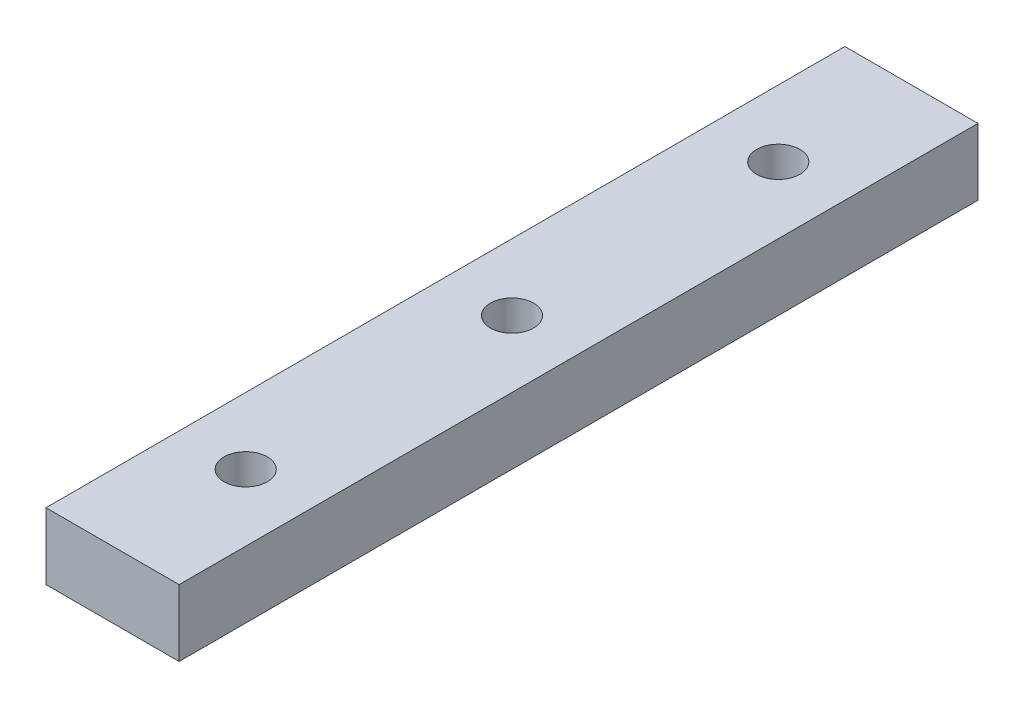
ISO-10303-21;
HEADER;
FILE_DESCRIPTION(('STEP AP214'),'2;1');
FILE_NAME('part.step','',(''),(''),'','','');
FILE_SCHEMA(('AUTOMOTIVE_DESIGN { 1 0 10303 214 1 1 1 1 }'));
ENDSEC;
DATA;
#1=APPLICATION_CONTEXT('core data for automotive mechanical design processes');
#2=APPLICATION_PROTOCOL_DEFINITION('international standard','automotive_design',2000,#1);
#3=PRODUCT_CONTEXT('',#1,'mechanical');
#4=PRODUCT('Part','Part','',(#3));
#5=PRODUCT_RELATED_PRODUCT_CATEGORY('part','',(#4));
#6=PRODUCT_DEFINITION_FORMATION('','',#4);
#7=PRODUCT_DEFINITION_CONTEXT('part definition',#1,'design');
#8=PRODUCT_DEFINITION('design','',#6,#7);
#9=PRODUCT_DEFINITION_SHAPE('','',#8);
#10=(LENGTH_UNIT() NAMED_UNIT(*) SI_UNIT(.MILLI.,.METRE.));
#11=(NAMED_UNIT(*) PLANE_ANGLE_UNIT() SI_UNIT($,.RADIAN.));
#12=(NAMED_UNIT(*) SI_UNIT($,.STERADIAN.) SOLID_ANGLE_UNIT());
#13=UNCERTAINTY_MEASURE_WITH_UNIT(LENGTH_MEASURE(1.E-05),#10,'distance_accuracy_value','');
#14=(GEOMETRIC_REPRESENTATION_CONTEXT(3) GLOBAL_UNCERTAINTY_ASSIGNED_CONTEXT((#13)) GLOBAL_UNIT_ASSIGNED_CONTEXT((#10,
#11,#12)) REPRESENTATION_CONTEXT('',''));
#15=CARTESIAN_POINT('',(0.,0.,0.));
#16=DIRECTION('',(0.,0.,1.));
#17=DIRECTION('',(1.,0.,0.));
#18=AXIS2_PLACEMENT_3D('',#15,#16,#17);
#19=CARTESIAN_POINT('',(0.,0.,-120.));
#20=DIRECTION('',(-1.,0.,0.));
#21=DIRECTION('',(0.,0.,1.));
#22=AXIS2_PLACEMENT_3D('',#19,#20,#21);
#23=PLANE('',#22);
#24=DIRECTION('',(0.,-1.,0.));
#25=VECTOR('',#24,1.);
#26=CARTESIAN_POINT('',(0.,0.,0.));
#27=LINE('',#26,#25);
#28=CARTESIAN_POINT('',(0.,10.,0.));
#29=VERTEX_POINT('',#28);
#30=CARTESIAN_POINT('',(0.,0.,0.));
#31=VERTEX_POINT('',#30);
#32=EDGE_CURVE('E68',#29,#31,#27,.T.);
#33=ORIENTED_EDGE('',*,*,#32,.F.);
#34=DIRECTION('',(0.,0.,1.));
#35=VECTOR('',#34,1.);
#36=CARTESIAN_POINT('',(0.,10.,-120.));
#37=LINE('',#36,#35);
#38=CARTESIAN_POINT('',(0.,10.,-120.));
#39=VERTEX_POINT('',#38);
#40=EDGE_CURVE('E11',#39,#29,#37,.T.);
#41=ORIENTED_EDGE('',*,*,#40,.F.);
#42=DIRECTION('',(0.,-1.,0.));
#43=VECTOR('',#42,1.);
#44=CARTESIAN_POINT('',(0.,0.,-120.));
#45=LINE('',#44,#43);
#46=CARTESIAN_POINT('',(0.,0.,-120.));
#47=VERTEX_POINT('',#46);
#48=EDGE_CURVE('E70',#39,#47,#45,.T.);
#49=ORIENTED_EDGE('',*,*,#48,.T.);
#50=DIRECTION('',(0.,0.,1.));
#51=VECTOR('',#50,1.);
#52=CARTESIAN_POINT('',(0.,0.,-120.));
#53=LINE('',#52,#51);
#54=EDGE_CURVE('E31',#47,#31,#53,.T.);
#55=ORIENTED_EDGE('',*,*,#54,.T.);
#56=EDGE_LOOP('',(#33,#41,#49,#55));
#57=FACE_BOUND('',#56,.T.);
#58=ADVANCED_FACE('F28',(#57),#23,.T.);
#59=CARTESIAN_POINT('',(0.,10.,-120.));
#60=DIRECTION('',(0.,1.,0.));
#61=DIRECTION('',(0.,0.,1.));
#62=AXIS2_PLACEMENT_3D('',#59,#60,#61);
#63=PLANE('',#62);
#64=CARTESIAN_POINT('',(10.,10.,-100.));
#65=DIRECTION('',(0.,1.,0.));
#66=DIRECTION('',(0.,0.,1.));
#67=AXIS2_PLACEMENT_3D('',#64,#65,#66);
#68=CIRCLE('',#67,3.25);
#69=CARTESIAN_POINT('',(10.,10.,-96.75));
#70=VERTEX_POINT('',#69);
#71=EDGE_CURVE('E131',#70,#70,#68,.T.);
#72=ORIENTED_EDGE('',*,*,#71,.F.);
#73=EDGE_LOOP('',(#72));
#74=FACE_BOUND('',#73,.T.);
#75=CARTESIAN_POINT('',(10.,10.,-20.));
#76=DIRECTION('',(0.,1.,0.));
#77=DIRECTION('',(0.,0.,1.));
#78=AXIS2_PLACEMENT_3D('',#75,#76,#77);
#79=CIRCLE('',#78,3.25);
#80=CARTESIAN_POINT('',(10.,10.,-16.75));
#81=VERTEX_POINT('',#80);
#82=EDGE_CURVE('E135',#81,#81,#79,.T.);
#83=ORIENTED_EDGE('',*,*,#82,.F.);
#84=EDGE_LOOP('',(#83));
#85=FACE_BOUND('',#84,.T.);
#86=CARTESIAN_POINT('',(10.,10.,-60.));
#87=DIRECTION('',(0.,1.,0.));
#88=DIRECTION('',(0.,0.,1.));
#89=AXIS2_PLACEMENT_3D('',#86,#87,#88);
#90=CIRCLE('',#89,3.25);
#91=CARTESIAN_POINT('',(10.,10.,-56.75));
#92=VERTEX_POINT('',#91);
#93=EDGE_CURVE('E89',#92,#92,#90,.T.);
#94=ORIENTED_EDGE('',*,*,#93,.F.);
#95=EDGE_LOOP('',(#94));
#96=FACE_BOUND('',#95,.T.);
#97=DIRECTION('',(-1.,0.,0.));
#98=VECTOR('',#97,1.);
#99=CARTESIAN_POINT('',(0.,10.,0.));
#100=LINE('',#99,#98);
#101=CARTESIAN_POINT('',(20.,10.,0.));
#102=VERTEX_POINT('',#101);
#103=EDGE_CURVE('E85',#102,#29,#100,.T.);
#104=ORIENTED_EDGE('',*,*,#103,.F.);
#105=DIRECTION('',(0.,0.,1.));
#106=VECTOR('',#105,1.);
#107=CARTESIAN_POINT('',(20.,10.,-120.));
#108=LINE('',#107,#106);
#109=CARTESIAN_POINT('',(20.,10.,-120.));
#110=VERTEX_POINT('',#109);
#111=EDGE_CURVE('E36',#110,#102,#108,.T.);
#112=ORIENTED_EDGE('',*,*,#111,.F.);
#113=DIRECTION('',(-1.,0.,0.));
#114=VECTOR('',#113,1.);
#115=CARTESIAN_POINT('',(0.,10.,-120.));
#116=LINE('',#115,#114);
#117=EDGE_CURVE('E75',#110,#39,#116,.T.);
#118=ORIENTED_EDGE('',*,*,#117,.T.);
#119=ORIENTED_EDGE('',*,*,#40,.T.);
#120=EDGE_LOOP('',(#104,#112,#118,#119));
#121=FACE_BOUND('',#120,.T.);
#122=ADVANCED_FACE('F105',(#74,#85,#96,#121),#63,.T.);
#123=CARTESIAN_POINT('',(20.,0.,-120.));
#124=DIRECTION('',(1.,0.,0.));
#125=DIRECTION('',(0.,0.,-1.));
#126=AXIS2_PLACEMENT_3D('',#123,#124,#125);
#127=PLANE('',#126);
#128=DIRECTION('',(0.,1.,0.));
#129=VECTOR('',#128,1.);
#130=CARTESIAN_POINT('',(20.,0.,0.));
#131=LINE('',#130,#129);
#132=CARTESIAN_POINT('',(20.,0.,0.));
#133=VERTEX_POINT('',#132);
#134=EDGE_CURVE('E82',#133,#102,#131,.T.);
#135=ORIENTED_EDGE('',*,*,#134,.F.);
#136=DIRECTION('',(0.,0.,1.));
#137=VECTOR('',#136,1.);
#138=CARTESIAN_POINT('',(20.,0.,-120.));
#139=LINE('',#138,#137);
#140=CARTESIAN_POINT('',(20.,0.,-120.));
#141=VERTEX_POINT('',#140);
#142=EDGE_CURVE('E74',#141,#133,#139,.T.);
#143=ORIENTED_EDGE('',*,*,#142,.F.);
#144=DIRECTION('',(0.,1.,0.));
#145=VECTOR('',#144,1.);
#146=CARTESIAN_POINT('',(20.,0.,-120.));
#147=LINE('',#146,#145);
#148=EDGE_CURVE('E98',#141,#110,#147,.T.);
#149=ORIENTED_EDGE('',*,*,#148,.T.);
#150=ORIENTED_EDGE('',*,*,#111,.T.);
#151=EDGE_LOOP('',(#135,#143,#149,#150));
#152=FACE_BOUND('',#151,.T.);
#153=ADVANCED_FACE('F102',(#152),#127,.T.);
#154=CARTESIAN_POINT('',(0.,0.,-120.));
#155=DIRECTION('',(0.,-1.,0.));
#156=DIRECTION('',(0.,0.,-1.));
#157=AXIS2_PLACEMENT_3D('',#154,#155,#156);
#158=PLANE('',#157);
#159=CARTESIAN_POINT('',(10.,0.,-100.));
#160=DIRECTION('',(0.,1.,0.));
#161=DIRECTION('',(0.,0.,1.));
#162=AXIS2_PLACEMENT_3D('',#159,#160,#161);
#163=CIRCLE('',#162,3.25);
#164=CARTESIAN_POINT('',(10.,0.,-96.75));
#165=VERTEX_POINT('',#164);
#166=EDGE_CURVE('E145',#165,#165,#163,.T.);
#167=ORIENTED_EDGE('',*,*,#166,.T.);
#168=EDGE_LOOP('',(#167));
#169=FACE_BOUND('',#168,.T.);
#170=CARTESIAN_POINT('',(10.,0.,-20.));
#171=DIRECTION('',(0.,1.,0.));
#172=DIRECTION('',(0.,0.,1.));
#173=AXIS2_PLACEMENT_3D('',#170,#171,#172);
#174=CIRCLE('',#173,3.25);
#175=CARTESIAN_POINT('',(10.,0.,-16.75));
#176=VERTEX_POINT('',#175);
#177=EDGE_CURVE('E139',#176,#176,#174,.T.);
#178=ORIENTED_EDGE('',*,*,#177,.T.);
#179=EDGE_LOOP('',(#178));
#180=FACE_BOUND('',#179,.T.);
#181=CARTESIAN_POINT('',(10.,0.,-60.));
#182=DIRECTION('',(0.,1.,0.));
#183=DIRECTION('',(0.,0.,1.));
#184=AXIS2_PLACEMENT_3D('',#181,#182,#183);
#185=CIRCLE('',#184,3.25);
#186=CARTESIAN_POINT('',(10.,0.,-56.75));
#187=VERTEX_POINT('',#186);
#188=EDGE_CURVE('E86',#187,#187,#185,.T.);
#189=ORIENTED_EDGE('',*,*,#188,.T.);
#190=EDGE_LOOP('',(#189));
#191=FACE_BOUND('',#190,.T.);
#192=DIRECTION('',(1.,0.,0.));
#193=VECTOR('',#192,1.);
#194=CARTESIAN_POINT('',(0.,0.,0.));
#195=LINE('',#194,#193);
#196=EDGE_CURVE('E77',#31,#133,#195,.T.);
#197=ORIENTED_EDGE('',*,*,#196,.F.);
#198=ORIENTED_EDGE('',*,*,#54,.F.);
#199=DIRECTION('',(1.,0.,0.));
#200=VECTOR('',#199,1.);
#201=CARTESIAN_POINT('',(0.,0.,-120.));
#202=LINE('',#201,#200);
#203=EDGE_CURVE('E96',#47,#141,#202,.T.);
#204=ORIENTED_EDGE('',*,*,#203,.T.);
#205=ORIENTED_EDGE('',*,*,#142,.T.);
#206=EDGE_LOOP('',(#197,#198,#204,#205));
#207=FACE_BOUND('',#206,.T.);
#208=ADVANCED_FACE('F78',(#169,#180,#191,#207),#158,.T.);
#209=CARTESIAN_POINT('',(0.,10.,-120.));
#210=DIRECTION('',(0.,0.,-1.));
#211=DIRECTION('',(-1.,0.,0.));
#212=AXIS2_PLACEMENT_3D('',#209,#210,#211);
#213=PLANE('',#212);
#214=ORIENTED_EDGE('',*,*,#48,.F.);
#215=ORIENTED_EDGE('',*,*,#117,.F.);
#216=ORIENTED_EDGE('',*,*,#148,.F.);
#217=ORIENTED_EDGE('',*,*,#203,.F.);
#218=EDGE_LOOP('',(#214,#215,#216,#217));
#219=FACE_BOUND('',#218,.T.);
#220=ADVANCED_FACE('F107',(#219),#213,.T.);
#221=CARTESIAN_POINT('',(0.,10.,0.));
#222=DIRECTION('',(0.,0.,-1.));
#223=DIRECTION('',(-1.,0.,0.));
#224=AXIS2_PLACEMENT_3D('',#221,#222,#223);
#225=PLANE('',#224);
#226=ORIENTED_EDGE('',*,*,#32,.T.);
#227=ORIENTED_EDGE('',*,*,#196,.T.);
#228=ORIENTED_EDGE('',*,*,#134,.T.);
#229=ORIENTED_EDGE('',*,*,#103,.T.);
#230=EDGE_LOOP('',(#226,#227,#228,#229));
#231=FACE_BOUND('',#230,.T.);
#232=ADVANCED_FACE('F84',(#231),#225,.F.);
#233=CARTESIAN_POINT('',(10.,0.,-60.));
#234=DIRECTION('',(0.,1.,0.));
#235=DIRECTION('',(0.,0.,1.));
#236=AXIS2_PLACEMENT_3D('',#233,#234,#235);
#237=CYLINDRICAL_SURFACE('',#236,3.25);
#238=ORIENTED_EDGE('',*,*,#188,.F.);
#239=EDGE_LOOP('',(#238));
#240=FACE_BOUND('',#239,.T.);
#241=ORIENTED_EDGE('',*,*,#93,.T.);
#242=EDGE_LOOP('',(#241));
#243=FACE_BOUND('',#242,.T.);
#244=ADVANCED_FACE('F114',(#240,#243),#237,.F.);
#245=CARTESIAN_POINT('',(10.,0.,-20.));
#246=DIRECTION('',(0.,1.,0.));
#247=DIRECTION('',(0.,0.,1.));
#248=AXIS2_PLACEMENT_3D('',#245,#246,#247);
#249=CYLINDRICAL_SURFACE('',#248,3.25);
#250=ORIENTED_EDGE('',*,*,#177,.F.);
#251=EDGE_LOOP('',(#250));
#252=FACE_BOUND('',#251,.T.);
#253=ORIENTED_EDGE('',*,*,#82,.T.);
#254=EDGE_LOOP('',(#253));
#255=FACE_BOUND('',#254,.T.);
#256=ADVANCED_FACE('F153',(#252,#255),#249,.F.);
#257=CARTESIAN_POINT('',(10.,0.,-100.));
#258=DIRECTION('',(0.,1.,0.));
#259=DIRECTION('',(0.,0.,1.));
#260=AXIS2_PLACEMENT_3D('',#257,#258,#259);
#261=CYLINDRICAL_SURFACE('',#260,3.25);
#262=ORIENTED_EDGE('',*,*,#166,.F.);
#263=EDGE_LOOP('',(#262));
#264=FACE_BOUND('',#263,.T.);
#265=ORIENTED_EDGE('',*,*,#71,.T.);
#266=EDGE_LOOP('',(#265));
#267=FACE_BOUND('',#266,.T.);
#268=ADVANCED_FACE('F150',(#264,#267),#261,.F.);
#269=CLOSED_SHELL('',(#58,#122,#153,#208,#220,#232,#244,#256,#268));
#270=MANIFOLD_SOLID_BREP('B2',#269);
#271=ADVANCED_BREP_SHAPE_REPRESENTATION('',(#18,#270),#14);
#272=SHAPE_DEFINITION_REPRESENTATION(#9,#271);
ENDSEC;
END-ISO-10303-21;
